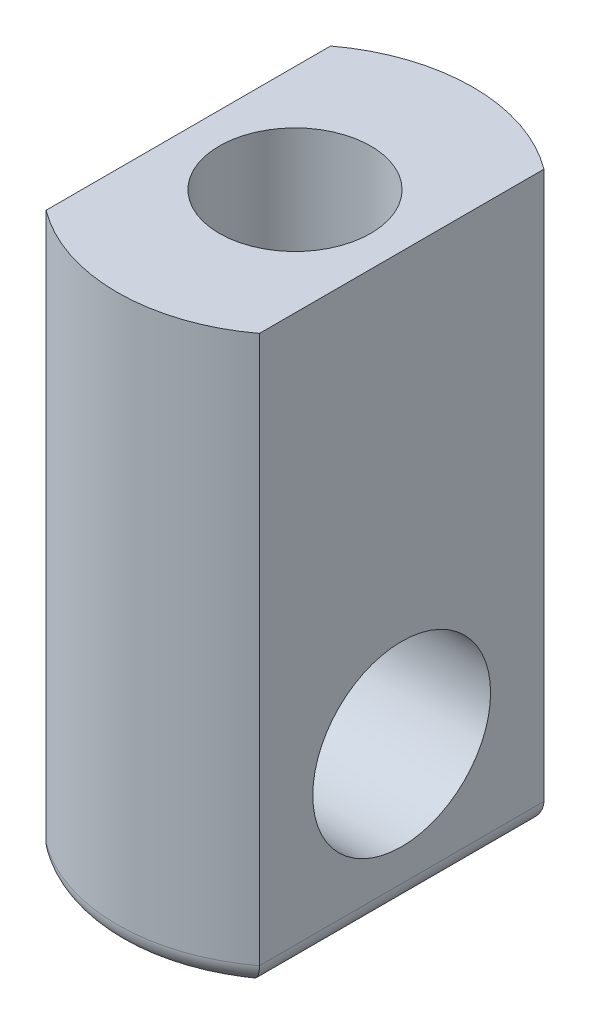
ISO-10303-21;
HEADER;
FILE_DESCRIPTION(('STEP AP214'),'2;1');
FILE_NAME('part.step','',(''),(''),'','','');
FILE_SCHEMA(('AUTOMOTIVE_DESIGN { 1 0 10303 214 1 1 1 1 }'));
ENDSEC;
DATA;
#1=APPLICATION_CONTEXT('core data for automotive mechanical design processes');
#2=APPLICATION_PROTOCOL_DEFINITION('international standard','automotive_design',2000,#1);
#3=PRODUCT_CONTEXT('',#1,'mechanical');
#4=PRODUCT('Part','Part','',(#3));
#5=PRODUCT_RELATED_PRODUCT_CATEGORY('part','',(#4));
#6=PRODUCT_DEFINITION_FORMATION('','',#4);
#7=PRODUCT_DEFINITION_CONTEXT('part definition',#1,'design');
#8=PRODUCT_DEFINITION('design','',#6,#7);
#9=PRODUCT_DEFINITION_SHAPE('','',#8);
#10=(LENGTH_UNIT() NAMED_UNIT(*) SI_UNIT(.MILLI.,.METRE.));
#11=(NAMED_UNIT(*) PLANE_ANGLE_UNIT() SI_UNIT($,.RADIAN.));
#12=(NAMED_UNIT(*) SI_UNIT($,.STERADIAN.) SOLID_ANGLE_UNIT());
#13=UNCERTAINTY_MEASURE_WITH_UNIT(LENGTH_MEASURE(1.E-05),#10,'distance_accuracy_value','');
#14=(GEOMETRIC_REPRESENTATION_CONTEXT(3) GLOBAL_UNCERTAINTY_ASSIGNED_CONTEXT((#13)) GLOBAL_UNIT_ASSIGNED_CONTEXT((#10,
#11,#12)) REPRESENTATION_CONTEXT('',''));
#15=CARTESIAN_POINT('',(0.,0.,0.));
#16=DIRECTION('',(0.,0.,1.));
#17=DIRECTION('',(1.,0.,0.));
#18=AXIS2_PLACEMENT_3D('',#15,#16,#17);
#19=CARTESIAN_POINT('',(0.,10.16,0.));
#20=DIRECTION('',(0.,-1.,0.));
#21=DIRECTION('',(0.,0.,-1.));
#22=AXIS2_PLACEMENT_3D('',#19,#20,#21);
#23=CYLINDRICAL_SURFACE('',#22,3.175);
#24=DIRECTION('',(0.,-1.,0.));
#25=VECTOR('',#24,1.);
#26=CARTESIAN_POINT('',(-1.905,10.16,2.54));
#27=LINE('',#26,#25);
#28=CARTESIAN_POINT('',(-1.905,10.16,2.54));
#29=VERTEX_POINT('',#28);
#30=CARTESIAN_POINT('',(-1.905,0.380999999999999,2.54));
#31=VERTEX_POINT('',#30);
#32=EDGE_CURVE('E112',#29,#31,#27,.T.);
#33=ORIENTED_EDGE('',*,*,#32,.T.);
#34=CARTESIAN_POINT('',(0.,0.380999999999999,0.));
#35=DIRECTION('',(0.,1.,0.));
#36=DIRECTION('',(0.,0.,1.));
#37=AXIS2_PLACEMENT_3D('',#34,#35,#36);
#38=CIRCLE('',#37,3.175);
#39=CARTESIAN_POINT('',(1.905,0.380999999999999,2.54));
#40=VERTEX_POINT('',#39);
#41=EDGE_CURVE('E11',#31,#40,#38,.T.);
#42=ORIENTED_EDGE('',*,*,#41,.T.);
#43=DIRECTION('',(0.,-1.,0.));
#44=VECTOR('',#43,1.);
#45=CARTESIAN_POINT('',(1.905,10.16,2.54));
#46=LINE('',#45,#44);
#47=CARTESIAN_POINT('',(1.905,10.16,2.54));
#48=VERTEX_POINT('',#47);
#49=EDGE_CURVE('E134',#48,#40,#46,.T.);
#50=ORIENTED_EDGE('',*,*,#49,.F.);
#51=CARTESIAN_POINT('',(0.,10.16,0.));
#52=DIRECTION('',(0.,1.,0.));
#53=DIRECTION('',(0.,0.,1.));
#54=AXIS2_PLACEMENT_3D('',#51,#52,#53);
#55=CIRCLE('',#54,3.175);
#56=EDGE_CURVE('E127',#29,#48,#55,.T.);
#57=ORIENTED_EDGE('',*,*,#56,.F.);
#58=EDGE_LOOP('',(#33,#42,#50,#57));
#59=FACE_BOUND('',#58,.T.);
#60=ADVANCED_FACE('F51',(#59),#23,.T.);
#61=DIRECTION('',(0.,-1.,0.));
#62=VECTOR('',#61,1.);
#63=CARTESIAN_POINT('',(1.905,10.16,-2.54));
#64=LINE('',#63,#62);
#65=CARTESIAN_POINT('',(1.905,10.16,-2.54));
#66=VERTEX_POINT('',#65);
#67=CARTESIAN_POINT('',(1.905,0.380999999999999,-2.54));
#68=VERTEX_POINT('',#67);
#69=EDGE_CURVE('E117',#66,#68,#64,.T.);
#70=ORIENTED_EDGE('',*,*,#69,.T.);
#71=CARTESIAN_POINT('',(0.,0.380999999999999,0.));
#72=DIRECTION('',(0.,1.,0.));
#73=DIRECTION('',(0.,0.,1.));
#74=AXIS2_PLACEMENT_3D('',#71,#72,#73);
#75=CIRCLE('',#74,3.175);
#76=CARTESIAN_POINT('',(-1.905,0.380999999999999,-2.54));
#77=VERTEX_POINT('',#76);
#78=EDGE_CURVE('E80',#68,#77,#75,.T.);
#79=ORIENTED_EDGE('',*,*,#78,.T.);
#80=DIRECTION('',(0.,-1.,0.));
#81=VECTOR('',#80,1.);
#82=CARTESIAN_POINT('',(-1.905,10.16,-2.54));
#83=LINE('',#82,#81);
#84=CARTESIAN_POINT('',(-1.905,10.16,-2.54));
#85=VERTEX_POINT('',#84);
#86=EDGE_CURVE('E111',#85,#77,#83,.T.);
#87=ORIENTED_EDGE('',*,*,#86,.F.);
#88=EDGE_CURVE('E121',#66,#85,#55,.T.);
#89=ORIENTED_EDGE('',*,*,#88,.F.);
#90=EDGE_LOOP('',(#70,#79,#87,#89));
#91=FACE_BOUND('',#90,.T.);
#92=ADVANCED_FACE('F120',(#91),#23,.T.);
#93=CARTESIAN_POINT('',(0.,10.16,0.));
#94=DIRECTION('',(0.,1.,0.));
#95=DIRECTION('',(0.,0.,1.));
#96=AXIS2_PLACEMENT_3D('',#93,#94,#95);
#97=PLANE('',#96);
#98=CARTESIAN_POINT('',(0.,10.16,0.));
#99=DIRECTION('',(0.,1.,0.));
#100=DIRECTION('',(0.,0.,1.));
#101=AXIS2_PLACEMENT_3D('',#98,#99,#100);
#102=CIRCLE('',#101,1.35255);
#103=CARTESIAN_POINT('',(0.,10.16,1.35255));
#104=VERTEX_POINT('',#103);
#105=EDGE_CURVE('E144',#104,#104,#102,.T.);
#106=ORIENTED_EDGE('',*,*,#105,.F.);
#107=EDGE_LOOP('',(#106));
#108=FACE_BOUND('',#107,.T.);
#109=DIRECTION('',(0.,0.,1.));
#110=VECTOR('',#109,1.);
#111=CARTESIAN_POINT('',(-1.905,10.16,2.54));
#112=LINE('',#111,#110);
#113=EDGE_CURVE('E109',#85,#29,#112,.T.);
#114=ORIENTED_EDGE('',*,*,#113,.T.);
#115=ORIENTED_EDGE('',*,*,#56,.T.);
#116=DIRECTION('',(0.,0.,-1.));
#117=VECTOR('',#116,1.);
#118=CARTESIAN_POINT('',(1.905,10.16,2.54));
#119=LINE('',#118,#117);
#120=EDGE_CURVE('E125',#48,#66,#119,.T.);
#121=ORIENTED_EDGE('',*,*,#120,.T.);
#122=ORIENTED_EDGE('',*,*,#88,.T.);
#123=EDGE_LOOP('',(#114,#115,#121,#122));
#124=FACE_BOUND('',#123,.T.);
#125=ADVANCED_FACE('F124',(#108,#124),#97,.T.);
#126=CARTESIAN_POINT('',(0.,0.,0.));
#127=DIRECTION('',(0.,1.,0.));
#128=DIRECTION('',(0.,0.,1.));
#129=AXIS2_PLACEMENT_3D('',#126,#127,#128);
#130=PLANE('',#129);
#131=CARTESIAN_POINT('',(0.,0.,0.));
#132=DIRECTION('',(0.,1.,0.));
#133=DIRECTION('',(0.,0.,1.));
#134=AXIS2_PLACEMENT_3D('',#131,#132,#133);
#135=CIRCLE('',#134,2.794);
#136=CARTESIAN_POINT('',(-1.524,0.,-2.34176429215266));
#137=VERTEX_POINT('',#136);
#138=CARTESIAN_POINT('',(1.52399999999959,0.,-2.34176429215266));
#139=VERTEX_POINT('',#138);
#140=EDGE_CURVE('E234',#137,#139,#135,.F.);
#141=ORIENTED_EDGE('',*,*,#140,.T.);
#142=DIRECTION('',(0.,0.,-1.));
#143=VECTOR('',#142,1.);
#144=CARTESIAN_POINT('',(1.524,0.,0.));
#145=LINE('',#144,#143);
#146=CARTESIAN_POINT('',(1.52399999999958,0.,2.34176429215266));
#147=VERTEX_POINT('',#146);
#148=EDGE_CURVE('E229',#139,#147,#145,.F.);
#149=ORIENTED_EDGE('',*,*,#148,.T.);
#150=CARTESIAN_POINT('',(0.,0.,0.));
#151=DIRECTION('',(0.,1.,0.));
#152=DIRECTION('',(0.,0.,1.));
#153=AXIS2_PLACEMENT_3D('',#150,#151,#152);
#154=CIRCLE('',#153,2.794);
#155=CARTESIAN_POINT('',(-1.52399999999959,0.,2.34176429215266));
#156=VERTEX_POINT('',#155);
#157=EDGE_CURVE('E130',#147,#156,#154,.F.);
#158=ORIENTED_EDGE('',*,*,#157,.T.);
#159=DIRECTION('',(0.,0.,1.));
#160=VECTOR('',#159,1.);
#161=CARTESIAN_POINT('',(-1.524,0.,0.));
#162=LINE('',#161,#160);
#163=EDGE_CURVE('E238',#156,#137,#162,.F.);
#164=ORIENTED_EDGE('',*,*,#163,.T.);
#165=EDGE_LOOP('',(#141,#149,#158,#164));
#166=FACE_BOUND('',#165,.T.);
#167=ADVANCED_FACE('F171',(#166),#130,.F.);
#168=CARTESIAN_POINT('',(1.905,10.16,2.54));
#169=DIRECTION('',(-1.,0.,0.));
#170=DIRECTION('',(0.,0.,1.));
#171=AXIS2_PLACEMENT_3D('',#168,#169,#170);
#172=PLANE('',#171);
#173=CARTESIAN_POINT('',(1.905,2.54,0.));
#174=DIRECTION('',(1.,0.,0.));
#175=DIRECTION('',(0.,0.,-1.));
#176=AXIS2_PLACEMENT_3D('',#173,#174,#175);
#177=CIRCLE('',#176,1.5875);
#178=CARTESIAN_POINT('',(1.905,2.54,-1.5875));
#179=VERTEX_POINT('',#178);
#180=EDGE_CURVE('E143',#179,#179,#177,.T.);
#181=ORIENTED_EDGE('',*,*,#180,.F.);
#182=EDGE_LOOP('',(#181));
#183=FACE_BOUND('',#182,.T.);
#184=ORIENTED_EDGE('',*,*,#49,.T.);
#185=DIRECTION('',(0.,0.,-1.));
#186=VECTOR('',#185,1.);
#187=CARTESIAN_POINT('',(1.905,0.380999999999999,2.54));
#188=LINE('',#187,#186);
#189=EDGE_CURVE('E126',#40,#68,#188,.T.);
#190=ORIENTED_EDGE('',*,*,#189,.T.);
#191=ORIENTED_EDGE('',*,*,#69,.F.);
#192=ORIENTED_EDGE('',*,*,#120,.F.);
#193=EDGE_LOOP('',(#184,#190,#191,#192));
#194=FACE_BOUND('',#193,.T.);
#195=ADVANCED_FACE('F224',(#183,#194),#172,.F.);
#196=CARTESIAN_POINT('',(-1.905,10.16,2.54));
#197=DIRECTION('',(1.,0.,0.));
#198=DIRECTION('',(0.,0.,-1.));
#199=AXIS2_PLACEMENT_3D('',#196,#197,#198);
#200=PLANE('',#199);
#201=CARTESIAN_POINT('',(-1.905,2.54,0.));
#202=DIRECTION('',(1.,0.,0.));
#203=DIRECTION('',(0.,0.,-1.));
#204=AXIS2_PLACEMENT_3D('',#201,#202,#203);
#205=CIRCLE('',#204,1.5875);
#206=CARTESIAN_POINT('',(-1.905,2.54,-1.5875));
#207=VERTEX_POINT('',#206);
#208=EDGE_CURVE('E215',#207,#207,#205,.T.);
#209=ORIENTED_EDGE('',*,*,#208,.T.);
#210=EDGE_LOOP('',(#209));
#211=FACE_BOUND('',#210,.T.);
#212=ORIENTED_EDGE('',*,*,#86,.T.);
#213=DIRECTION('',(0.,0.,1.));
#214=VECTOR('',#213,1.);
#215=CARTESIAN_POINT('',(-1.905,0.380999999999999,2.54));
#216=LINE('',#215,#214);
#217=EDGE_CURVE('E65',#77,#31,#216,.T.);
#218=ORIENTED_EDGE('',*,*,#217,.T.);
#219=ORIENTED_EDGE('',*,*,#32,.F.);
#220=ORIENTED_EDGE('',*,*,#113,.F.);
#221=EDGE_LOOP('',(#212,#218,#219,#220));
#222=FACE_BOUND('',#221,.T.);
#223=ADVANCED_FACE('F110',(#211,#222),#200,.F.);
#224=CARTESIAN_POINT('',(-1.905,2.54,0.));
#225=DIRECTION('',(1.,0.,0.));
#226=DIRECTION('',(0.,0.,-1.));
#227=AXIS2_PLACEMENT_3D('',#224,#225,#226);
#228=CYLINDRICAL_SURFACE('',#227,1.5875);
#229=CARTESIAN_POINT('',(0.,3.37112258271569,1.35255));
#230=CARTESIAN_POINT('',(0.045934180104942,3.37113229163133,1.35254649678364));
#231=CARTESIAN_POINT('',(0.0919452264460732,3.37501786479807,1.35017916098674));
#232=CARTESIAN_POINT('',(0.182421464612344,3.38971828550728,1.34097097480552));
#233=CARTESIAN_POINT('',(0.226880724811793,3.40055718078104,1.33411459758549));
#234=CARTESIAN_POINT('',(0.331196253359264,3.43278611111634,1.31285522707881));
#235=CARTESIAN_POINT('',(0.389855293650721,3.4566829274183,1.29650738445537));
#236=CARTESIAN_POINT('',(0.502340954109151,3.50986765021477,1.25722556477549));
#237=CARTESIAN_POINT('',(0.556149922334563,3.53917415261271,1.23426871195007));
#238=CARTESIAN_POINT('',(0.685380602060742,3.61543385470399,1.16927502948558));
#239=CARTESIAN_POINT('',(0.758047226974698,3.66384411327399,1.12345076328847));
#240=CARTESIAN_POINT('',(0.893861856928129,3.759628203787,1.01868892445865));
#241=CARTESIAN_POINT('',(0.95701921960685,3.80700301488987,0.959764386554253));
#242=CARTESIAN_POINT('',(1.05979683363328,3.88652605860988,0.843120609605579));
#243=CARTESIAN_POINT('',(1.10153674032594,3.91972896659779,0.787997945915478));
#244=CARTESIAN_POINT('',(1.17707851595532,3.98075795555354,0.669904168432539));
#245=CARTESIAN_POINT('',(1.21089350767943,4.00859291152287,0.60694629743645));
#246=CARTESIAN_POINT('',(1.26363828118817,4.05240646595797,0.48595231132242));
#247=CARTESIAN_POINT('',(1.28414966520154,4.06961591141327,0.429056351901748));
#248=CARTESIAN_POINT('',(1.31758411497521,4.09779038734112,0.311583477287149));
#249=CARTESIAN_POINT('',(1.33051163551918,4.10875908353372,0.251008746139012));
#250=CARTESIAN_POINT('',(1.34797697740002,4.12359880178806,0.127494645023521));
#251=CARTESIAN_POINT('',(1.3524758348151,4.12743685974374,0.0645456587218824));
#252=CARTESIAN_POINT('',(1.35262230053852,4.12756155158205,-0.0613694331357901));
#253=CARTESIAN_POINT('',(1.34827070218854,4.12384886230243,-0.124335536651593));
#254=CARTESIAN_POINT('',(1.33170117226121,4.10976937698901,-0.243547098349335));
#255=CARTESIAN_POINT('',(1.32009648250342,4.09992149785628,-0.299942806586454));
#256=CARTESIAN_POINT('',(1.29027386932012,4.07476626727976,-0.409657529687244));
#257=CARTESIAN_POINT('',(1.27205489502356,4.0594580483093,-0.462976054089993));
#258=CARTESIAN_POINT('',(1.228187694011,4.02291951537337,-0.569676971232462));
#259=CARTESIAN_POINT('',(1.20206902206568,4.00131902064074,-0.622736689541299));
#260=CARTESIAN_POINT('',(1.14414792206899,3.95405798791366,-0.723677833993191));
#261=CARTESIAN_POINT('',(1.11234113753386,3.92839433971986,-0.771555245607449));
#262=CARTESIAN_POINT('',(1.02684974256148,3.8606794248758,-0.884412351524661));
#263=CARTESIAN_POINT('',(0.970155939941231,3.81682971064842,-0.946042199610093));
#264=CARTESIAN_POINT('',(0.847655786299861,3.72639953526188,-1.05723677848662));
#265=CARTESIAN_POINT('',(0.781829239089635,3.67981315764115,-1.10677407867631));
#266=CARTESIAN_POINT('',(0.657121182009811,3.59870757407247,-1.18393064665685));
#267=CARTESIAN_POINT('',(0.599967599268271,3.56381531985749,-1.21397416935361));
#268=CARTESIAN_POINT('',(0.479894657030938,3.49839595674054,-1.26624025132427));
#269=CARTESIAN_POINT('',(0.41699338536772,3.46785587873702,-1.28848634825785));
#270=CARTESIAN_POINT('',(0.310196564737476,3.42633786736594,-1.31717214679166));
#271=CARTESIAN_POINT('',(0.268250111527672,3.41234770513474,-1.3264023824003));
#272=CARTESIAN_POINT('',(0.18228199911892,3.38987125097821,-1.34091590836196));
#273=CARTESIAN_POINT('',(0.13826591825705,3.38137098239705,-1.34620922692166));
#274=CARTESIAN_POINT('',(0.0486524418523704,3.37135061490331,-1.35242516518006));
#275=CARTESIAN_POINT('',(0.00304387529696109,3.36989876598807,-1.35330505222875));
#276=CARTESIAN_POINT('',(-0.0876609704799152,3.37449873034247,-1.35047119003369));
#277=CARTESIAN_POINT('',(-0.132756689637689,3.3805580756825,-1.34675282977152));
#278=CARTESIAN_POINT('',(-0.229686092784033,3.40072001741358,-1.33397091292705));
#279=CARTESIAN_POINT('',(-0.281106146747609,3.41616728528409,-1.32400187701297));
#280=CARTESIAN_POINT('',(-0.380527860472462,3.45291584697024,-1.29893665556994));
#281=CARTESIAN_POINT('',(-0.428516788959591,3.47423764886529,-1.28382246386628));
#282=CARTESIAN_POINT('',(-0.551387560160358,3.53515273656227,-1.23776653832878));
#283=CARTESIAN_POINT('',(-0.623379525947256,3.57758869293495,-1.20293294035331));
#284=CARTESIAN_POINT('',(-0.7593381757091,3.66457859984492,-1.1220741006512));
#285=CARTESIAN_POINT('',(-0.823290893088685,3.7091360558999,-1.07602977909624));
#286=CARTESIAN_POINT('',(-0.945711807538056,3.79829614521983,-0.970481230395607));
#287=CARTESIAN_POINT('',(-1.00381180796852,3.84281343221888,-0.910471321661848));
#288=CARTESIAN_POINT('',(-1.10939982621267,3.92581490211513,-0.778286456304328));
#289=CARTESIAN_POINT('',(-1.15691925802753,3.9643168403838,-0.706148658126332));
#290=CARTESIAN_POINT('',(-1.22581560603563,4.02092450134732,-0.574823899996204));
#291=CARTESIAN_POINT('',(-1.25072362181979,4.04164628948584,-0.518615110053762));
#292=CARTESIAN_POINT('',(-1.29303627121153,4.07706616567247,-0.401630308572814));
#293=CARTESIAN_POINT('',(-1.31044643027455,4.09176868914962,-0.34085769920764));
#294=CARTESIAN_POINT('',(-1.33676375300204,4.1140561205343,-0.215778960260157));
#295=CARTESIAN_POINT('',(-1.34561596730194,4.12159502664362,-0.151452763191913));
#296=CARTESIAN_POINT('',(-1.35393276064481,4.12867662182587,-0.0217600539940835));
#297=CARTESIAN_POINT('',(-1.35340088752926,4.12822233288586,0.0436060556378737));
#298=CARTESIAN_POINT('',(-1.34352607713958,4.11981708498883,0.166608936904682));
#299=CARTESIAN_POINT('',(-1.33505812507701,4.11261060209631,0.224371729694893));
#300=CARTESIAN_POINT('',(-1.3110825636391,4.09230852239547,0.337327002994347));
#301=CARTESIAN_POINT('',(-1.29557351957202,4.0792117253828,0.392518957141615));
#302=CARTESIAN_POINT('',(-1.25756240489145,4.04735385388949,0.501387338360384));
#303=CARTESIAN_POINT('',(-1.23480163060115,4.02838411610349,0.554910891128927));
#304=CARTESIAN_POINT('',(-1.18351783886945,3.98612232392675,0.657234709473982));
#305=CARTESIAN_POINT('',(-1.15499323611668,3.96282908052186,0.706033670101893));
#306=CARTESIAN_POINT('',(-1.07812755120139,3.90101747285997,0.820877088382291));
#307=CARTESIAN_POINT('',(-1.02685364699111,3.86056443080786,0.883928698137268));
#308=CARTESIAN_POINT('',(-0.915408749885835,3.77588665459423,0.998936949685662));
#309=CARTESIAN_POINT('',(-0.855203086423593,3.73164752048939,1.05084833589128));
#310=CARTESIAN_POINT('',(-0.725425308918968,3.6421358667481,1.14441538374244));
#311=CARTESIAN_POINT('',(-0.655690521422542,3.59686031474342,1.1858461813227));
#312=CARTESIAN_POINT('',(-0.544527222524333,3.53316582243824,1.23876934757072));
#313=CARTESIAN_POINT('',(-0.506439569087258,3.5126643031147,1.25485645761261));
#314=CARTESIAN_POINT('',(-0.427864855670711,3.47416126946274,1.28377334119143));
#315=CARTESIAN_POINT('',(-0.387381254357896,3.45615627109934,1.29660767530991));
#316=CARTESIAN_POINT('',(-0.303732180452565,3.42403726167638,1.31871797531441));
#317=CARTESIAN_POINT('',(-0.260557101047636,3.40993829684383,1.32798023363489));
#318=CARTESIAN_POINT('',(-0.172101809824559,3.38769161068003,1.34229548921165));
#319=CARTESIAN_POINT('',(-0.126831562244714,3.37951829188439,1.34736660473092));
#320=CARTESIAN_POINT('',(-0.0676508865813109,3.37376184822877,1.35092508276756));
#321=CARTESIAN_POINT('',(-0.0541504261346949,3.37277550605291,1.35153320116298));
#322=CARTESIAN_POINT('',(-0.027102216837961,3.37145434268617,1.35234623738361));
#323=CARTESIAN_POINT('',(-0.0135544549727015,3.3711197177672,1.35255103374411));
#324=CARTESIAN_POINT('',(0.,3.37112258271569,1.35255));
#325=B_SPLINE_CURVE_WITH_KNOTS('',3,(#229,#230,#231,#232,#233,#234,#235,#236,#237,#238,#239,
#240,#241,#242,#243,#244,#245,#246,#247,#248,#249,#250,#251,#252,#253,#254,#255,#256,#257,#258,
#259,#260,#261,#262,#263,#264,#265,#266,#267,#268,#269,#270,#271,#272,#273,#274,#275,#276,#277,
#278,#279,#280,#281,#282,#283,#284,#285,#286,#287,#288,#289,#290,#291,#292,#293,#294,#295,#296,
#297,#298,#299,#300,#301,#302,#303,#304,#305,#306,#307,#308,#309,#310,#311,#312,#313,#314,#315,
#316,#317,#318,#319,#320,#321,#322,#323,#324),.UNSPECIFIED.,.T.,.F.,(4,2,2,2,2,2,2,2,2,2,2,2,2,
2,2,2,2,2,2,2,2,2,2,2,2,2,2,2,2,2,2,2,2,2,2,2,2,2,2,2,2,2,2,2,2,2,2,4),(0.,0.137740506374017,
0.275959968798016,0.471087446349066,0.666898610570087,0.96127586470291,1.25536151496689,
1.48463192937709,1.71351997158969,1.90138620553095,2.08914197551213,2.27776357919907,
2.4663682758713,2.64085443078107,2.81536832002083,3.00356317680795,3.19190279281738,
3.47399237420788,3.75671601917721,3.97635216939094,4.19531948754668,4.33041209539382,
4.46515940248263,4.6012089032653,4.73739494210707,4.90029675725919,5.06377463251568,
5.33394888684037,5.60458621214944,5.88720611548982,6.16897537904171,6.36286208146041,
6.55660565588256,6.75158512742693,6.94649088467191,7.12215612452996,7.29785717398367,
7.48070245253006,7.66359809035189,7.934452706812,8.206387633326,8.48373886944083,
8.62201178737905,8.76008975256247,8.89869243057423,9.03669274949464,9.07732557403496,
9.11797063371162),.UNSPECIFIED.);
#326=CARTESIAN_POINT('',(0.,3.37112258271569,1.35255));
#327=VERTEX_POINT('',#326);
#328=EDGE_CURVE('E136',#327,#327,#325,.T.);
#329=ORIENTED_EDGE('',*,*,#328,.T.);
#330=EDGE_LOOP('',(#329));
#331=FACE_BOUND('',#330,.T.);
#332=ORIENTED_EDGE('',*,*,#208,.F.);
#333=EDGE_LOOP('',(#332));
#334=FACE_BOUND('',#333,.T.);
#335=ORIENTED_EDGE('',*,*,#180,.T.);
#336=EDGE_LOOP('',(#335));
#337=FACE_BOUND('',#336,.T.);
#338=ADVANCED_FACE('F146',(#331,#334,#337),#228,.F.);
#339=CARTESIAN_POINT('',(0.,10.16,0.));
#340=DIRECTION('',(0.,1.,0.));
#341=DIRECTION('',(0.,0.,1.));
#342=AXIS2_PLACEMENT_3D('',#339,#340,#341);
#343=CYLINDRICAL_SURFACE('',#342,1.35255);
#344=ORIENTED_EDGE('',*,*,#105,.T.);
#345=EDGE_LOOP('',(#344));
#346=FACE_BOUND('',#345,.T.);
#347=ORIENTED_EDGE('',*,*,#328,.F.);
#348=EDGE_LOOP('',(#347));
#349=FACE_BOUND('',#348,.T.);
#350=ADVANCED_FACE('F149',(#346,#349),#343,.F.);
#351=CARTESIAN_POINT('',(-1.524,0.380999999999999,2.54));
#352=DIRECTION('',(0.,0.,1.));
#353=DIRECTION('',(1.,0.,0.));
#354=AXIS2_PLACEMENT_3D('',#351,#352,#353);
#355=CYLINDRICAL_SURFACE('',#354,0.381);
#356=CARTESIAN_POINT('',(-1.905,0.380999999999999,-2.54));
#357=CARTESIAN_POINT('',(-1.90502421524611,0.361214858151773,-2.54001076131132));
#358=CARTESIAN_POINT('',(-1.90346055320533,0.341447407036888,-2.53923027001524));
#359=CARTESIAN_POINT('',(-1.89734965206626,0.302566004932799,-2.53617275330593));
#360=CARTESIAN_POINT('',(-1.89281278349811,0.283450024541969,-2.53390092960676));
#361=CARTESIAN_POINT('',(-1.88094827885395,0.246354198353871,-2.52794717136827));
#362=CARTESIAN_POINT('',(-1.87362206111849,0.228373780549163,-2.5242659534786));
#363=CARTESIAN_POINT('',(-1.85648796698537,0.193964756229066,-2.51563076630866));
#364=CARTESIAN_POINT('',(-1.84667869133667,0.177537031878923,-2.51067607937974));
#365=CARTESIAN_POINT('',(-1.82450198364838,0.145953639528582,-2.49943348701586));
#366=CARTESIAN_POINT('',(-1.8120477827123,0.13087533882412,-2.49310010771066));
#367=CARTESIAN_POINT('',(-1.785269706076,0.103020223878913,-2.47942167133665));
#368=CARTESIAN_POINT('',(-1.77094530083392,0.0902440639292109,-2.47207632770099));
#369=CARTESIAN_POINT('',(-1.73933666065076,0.0659977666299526,-2.45578659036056));
#370=CARTESIAN_POINT('',(-1.72189970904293,0.0547851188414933,-2.44675577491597));
#371=CARTESIAN_POINT('',(-1.68576736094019,0.0354384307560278,-2.4279286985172));
#372=CARTESIAN_POINT('',(-1.66707101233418,0.0273067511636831,-2.41813185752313));
#373=CARTESIAN_POINT('',(-1.62845025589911,0.0140147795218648,-2.39776350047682));
#374=CARTESIAN_POINT('',(-1.60850735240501,0.00892843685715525,-2.38717922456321));
#375=CARTESIAN_POINT('',(-1.56827650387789,0.00203313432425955,-2.3656790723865));
#376=CARTESIAN_POINT('',(-1.54798931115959,0.00021777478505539,-2.3547638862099));
#377=CARTESIAN_POINT('',(-1.52649899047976,6.13506016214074E-06,-2.34311926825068));
#378=CARTESIAN_POINT('',(-1.52524937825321,-1.1652303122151E-08,-2.34244186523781));
#379=CARTESIAN_POINT('',(-1.524,0.,-2.34176429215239));
#380=B_SPLINE_CURVE_WITH_KNOTS('',3,(#356,#357,#358,#359,#360,#361,#362,#363,#364,#365,#366,
#367,#368,#369,#370,#371,#372,#373,#374,#375,#376,#377,#378,#379),.UNSPECIFIED.,.F.,.F.,(4,2,2,
2,2,2,2,2,2,2,2,4),(0.,0.0592507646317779,0.118295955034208,0.177311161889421,0.236359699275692,
0.297774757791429,0.359207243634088,0.42676905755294,0.494382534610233,0.5635774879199,
0.632636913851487,0.636901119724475),.UNSPECIFIED.);
#381=EDGE_CURVE('E188',#137,#77,#380,.F.);
#382=ORIENTED_EDGE('',*,*,#381,.F.);
#383=ORIENTED_EDGE('',*,*,#163,.F.);
#384=CARTESIAN_POINT('',(-1.905,0.380999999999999,2.54));
#385=CARTESIAN_POINT('',(-1.90502421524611,0.361214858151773,2.54001076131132));
#386=CARTESIAN_POINT('',(-1.90346055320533,0.341447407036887,2.53923027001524));
#387=CARTESIAN_POINT('',(-1.89734965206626,0.302566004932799,2.53617275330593));
#388=CARTESIAN_POINT('',(-1.89281278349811,0.283450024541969,2.53390092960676));
#389=CARTESIAN_POINT('',(-1.88094827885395,0.246354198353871,2.52794717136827));
#390=CARTESIAN_POINT('',(-1.87362206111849,0.228373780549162,2.5242659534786));
#391=CARTESIAN_POINT('',(-1.85648796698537,0.193964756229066,2.51563076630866));
#392=CARTESIAN_POINT('',(-1.84667869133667,0.177537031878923,2.51067607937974));
#393=CARTESIAN_POINT('',(-1.82450198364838,0.145953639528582,2.49943348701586));
#394=CARTESIAN_POINT('',(-1.8120477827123,0.13087533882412,2.49310010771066));
#395=CARTESIAN_POINT('',(-1.785269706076,0.103020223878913,2.47942167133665));
#396=CARTESIAN_POINT('',(-1.77094530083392,0.090244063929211,2.47207632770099));
#397=CARTESIAN_POINT('',(-1.73933666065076,0.0659977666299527,2.45578659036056));
#398=CARTESIAN_POINT('',(-1.72189970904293,0.0547851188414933,2.44675577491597));
#399=CARTESIAN_POINT('',(-1.68576736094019,0.0354384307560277,2.4279286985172));
#400=CARTESIAN_POINT('',(-1.66707101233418,0.027306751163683,2.41813185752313));
#401=CARTESIAN_POINT('',(-1.62845025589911,0.0140147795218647,2.39776350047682));
#402=CARTESIAN_POINT('',(-1.60850735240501,0.00892843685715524,2.3871792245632));
#403=CARTESIAN_POINT('',(-1.56827650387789,0.00203313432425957,2.36567907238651));
#404=CARTESIAN_POINT('',(-1.54798931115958,0.000217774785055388,2.35476388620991));
#405=CARTESIAN_POINT('',(-1.52649899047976,6.13506016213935E-06,2.34311926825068));
#406=CARTESIAN_POINT('',(-1.52524937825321,-1.16523031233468E-08,2.34244186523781));
#407=CARTESIAN_POINT('',(-1.524,0.,2.34176429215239));
#408=B_SPLINE_CURVE_WITH_KNOTS('',3,(#384,#385,#386,#387,#388,#389,#390,#391,#392,#393,#394,
#395,#396,#397,#398,#399,#400,#401,#402,#403,#404,#405,#406,#407),.UNSPECIFIED.,.F.,.F.,(4,2,2,
2,2,2,2,2,2,2,2,4),(0.,0.059250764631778,0.118295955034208,0.177311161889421,0.236359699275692,
0.297774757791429,0.359207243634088,0.42676905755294,0.494382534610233,0.5635774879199,
0.632636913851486,0.636901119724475),.UNSPECIFIED.);
#409=EDGE_CURVE('E56',#31,#156,#408,.T.);
#410=ORIENTED_EDGE('',*,*,#409,.F.);
#411=ORIENTED_EDGE('',*,*,#217,.F.);
#412=EDGE_LOOP('',(#382,#383,#410,#411));
#413=FACE_BOUND('',#412,.T.);
#414=ADVANCED_FACE('F53',(#413),#355,.T.);
#415=CARTESIAN_POINT('',(0.,0.380999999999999,0.));
#416=DIRECTION('',(0.,1.,0.));
#417=DIRECTION('',(0.,0.,1.));
#418=AXIS2_PLACEMENT_3D('',#415,#416,#417);
#419=TOROIDAL_SURFACE('',#418,2.794,0.381);
#420=ORIENTED_EDGE('',*,*,#409,.T.);
#421=ORIENTED_EDGE('',*,*,#157,.F.);
#422=CARTESIAN_POINT('',(1.905,0.380999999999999,2.54));
#423=CARTESIAN_POINT('',(1.90502421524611,0.361214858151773,2.54001076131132));
#424=CARTESIAN_POINT('',(1.90346055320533,0.341447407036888,2.53923027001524));
#425=CARTESIAN_POINT('',(1.89734965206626,0.302566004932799,2.53617275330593));
#426=CARTESIAN_POINT('',(1.89281278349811,0.283450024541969,2.53390092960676));
#427=CARTESIAN_POINT('',(1.88094827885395,0.246354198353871,2.52794717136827));
#428=CARTESIAN_POINT('',(1.87362206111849,0.228373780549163,2.5242659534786));
#429=CARTESIAN_POINT('',(1.85648796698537,0.193964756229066,2.51563076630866));
#430=CARTESIAN_POINT('',(1.84667869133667,0.177537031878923,2.51067607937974));
#431=CARTESIAN_POINT('',(1.82450198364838,0.145953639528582,2.49943348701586));
#432=CARTESIAN_POINT('',(1.8120477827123,0.13087533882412,2.49310010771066));
#433=CARTESIAN_POINT('',(1.785269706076,0.103020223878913,2.47942167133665));
#434=CARTESIAN_POINT('',(1.77094530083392,0.0902440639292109,2.47207632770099));
#435=CARTESIAN_POINT('',(1.73933666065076,0.0659977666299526,2.45578659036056));
#436=CARTESIAN_POINT('',(1.72189970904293,0.0547851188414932,2.44675577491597));
#437=CARTESIAN_POINT('',(1.68576736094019,0.0354384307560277,2.4279286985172));
#438=CARTESIAN_POINT('',(1.66707101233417,0.0273067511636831,2.41813185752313));
#439=CARTESIAN_POINT('',(1.62845025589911,0.0140147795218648,2.39776350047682));
#440=CARTESIAN_POINT('',(1.60850735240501,0.00892843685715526,2.3871792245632));
#441=CARTESIAN_POINT('',(1.56827650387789,0.00203313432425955,2.36567907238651));
#442=CARTESIAN_POINT('',(1.54798931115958,0.000217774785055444,2.35476388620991));
#443=CARTESIAN_POINT('',(1.52649899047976,6.13506016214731E-06,2.34311926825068));
#444=CARTESIAN_POINT('',(1.52524937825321,-1.16523031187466E-08,2.34244186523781));
#445=CARTESIAN_POINT('',(1.524,0.,2.34176429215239));
#446=B_SPLINE_CURVE_WITH_KNOTS('',3,(#422,#423,#424,#425,#426,#427,#428,#429,#430,#431,#432,
#433,#434,#435,#436,#437,#438,#439,#440,#441,#442,#443,#444,#445),.UNSPECIFIED.,.F.,.F.,(4,2,2,
2,2,2,2,2,2,2,2,4),(0.,0.0592507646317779,0.118295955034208,0.177311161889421,0.236359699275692,
0.297774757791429,0.359207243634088,0.42676905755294,0.494382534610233,0.563577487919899,
0.632636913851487,0.636901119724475),.UNSPECIFIED.);
#447=EDGE_CURVE('E194',#40,#147,#446,.T.);
#448=ORIENTED_EDGE('',*,*,#447,.F.);
#449=ORIENTED_EDGE('',*,*,#41,.F.);
#450=EDGE_LOOP('',(#420,#421,#448,#449));
#451=FACE_BOUND('',#450,.T.);
#452=ADVANCED_FACE('F156',(#451),#419,.T.);
#453=CARTESIAN_POINT('',(0.,0.380999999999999,0.));
#454=DIRECTION('',(0.,1.,0.));
#455=DIRECTION('',(0.,0.,1.));
#456=AXIS2_PLACEMENT_3D('',#453,#454,#455);
#457=TOROIDAL_SURFACE('',#456,2.794,0.381);
#458=ORIENTED_EDGE('',*,*,#381,.T.);
#459=ORIENTED_EDGE('',*,*,#78,.F.);
#460=CARTESIAN_POINT('',(1.905,0.380999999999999,-2.54));
#461=CARTESIAN_POINT('',(1.90502421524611,0.361214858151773,-2.54001076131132));
#462=CARTESIAN_POINT('',(1.90346055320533,0.341447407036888,-2.53923027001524));
#463=CARTESIAN_POINT('',(1.89734965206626,0.302566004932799,-2.53617275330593));
#464=CARTESIAN_POINT('',(1.89281278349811,0.283450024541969,-2.53390092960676));
#465=CARTESIAN_POINT('',(1.88094827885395,0.246354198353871,-2.52794717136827));
#466=CARTESIAN_POINT('',(1.87362206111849,0.228373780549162,-2.5242659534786));
#467=CARTESIAN_POINT('',(1.85648796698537,0.193964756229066,-2.51563076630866));
#468=CARTESIAN_POINT('',(1.84667869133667,0.177537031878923,-2.51067607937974));
#469=CARTESIAN_POINT('',(1.82450198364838,0.145953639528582,-2.49943348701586));
#470=CARTESIAN_POINT('',(1.8120477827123,0.13087533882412,-2.49310010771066));
#471=CARTESIAN_POINT('',(1.785269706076,0.103020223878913,-2.47942167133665));
#472=CARTESIAN_POINT('',(1.77094530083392,0.0902440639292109,-2.47207632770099));
#473=CARTESIAN_POINT('',(1.73933666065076,0.0659977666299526,-2.45578659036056));
#474=CARTESIAN_POINT('',(1.72189970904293,0.0547851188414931,-2.44675577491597));
#475=CARTESIAN_POINT('',(1.68576736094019,0.0354384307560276,-2.4279286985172));
#476=CARTESIAN_POINT('',(1.66707101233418,0.0273067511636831,-2.41813185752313));
#477=CARTESIAN_POINT('',(1.62845025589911,0.0140147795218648,-2.39776350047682));
#478=CARTESIAN_POINT('',(1.60850735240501,0.00892843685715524,-2.38717922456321));
#479=CARTESIAN_POINT('',(1.56827650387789,0.00203313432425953,-2.3656790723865));
#480=CARTESIAN_POINT('',(1.54798931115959,0.000217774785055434,-2.35476388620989));
#481=CARTESIAN_POINT('',(1.52649899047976,6.13506016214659E-06,-2.34311926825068));
#482=CARTESIAN_POINT('',(1.52524937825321,-1.16523031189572E-08,-2.34244186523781));
#483=CARTESIAN_POINT('',(1.524,0.,-2.34176429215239));
#484=B_SPLINE_CURVE_WITH_KNOTS('',3,(#460,#461,#462,#463,#464,#465,#466,#467,#468,#469,#470,
#471,#472,#473,#474,#475,#476,#477,#478,#479,#480,#481,#482,#483),.UNSPECIFIED.,.F.,.F.,(4,2,2,
2,2,2,2,2,2,2,2,4),(0.,0.0592507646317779,0.118295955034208,0.177311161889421,0.236359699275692,
0.297774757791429,0.359207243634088,0.42676905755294,0.494382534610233,0.5635774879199,
0.632636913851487,0.636901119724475),.UNSPECIFIED.);
#485=EDGE_CURVE('E182',#139,#68,#484,.F.);
#486=ORIENTED_EDGE('',*,*,#485,.F.);
#487=ORIENTED_EDGE('',*,*,#140,.F.);
#488=EDGE_LOOP('',(#458,#459,#486,#487));
#489=FACE_BOUND('',#488,.T.);
#490=ADVANCED_FACE('F173',(#489),#457,.T.);
#491=CARTESIAN_POINT('',(1.524,0.380999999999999,2.54));
#492=DIRECTION('',(0.,0.,-1.));
#493=DIRECTION('',(-1.,0.,0.));
#494=AXIS2_PLACEMENT_3D('',#491,#492,#493);
#495=CYLINDRICAL_SURFACE('',#494,0.381);
#496=ORIENTED_EDGE('',*,*,#447,.T.);
#497=ORIENTED_EDGE('',*,*,#148,.F.);
#498=ORIENTED_EDGE('',*,*,#485,.T.);
#499=ORIENTED_EDGE('',*,*,#189,.F.);
#500=EDGE_LOOP('',(#496,#497,#498,#499));
#501=FACE_BOUND('',#500,.T.);
#502=ADVANCED_FACE('F177',(#501),#495,.T.);
#503=CLOSED_SHELL('',(#60,#92,#125,#167,#195,#223,#338,#350,#414,#452,#490,#502));
#504=MANIFOLD_SOLID_BREP('B2',#503);
#505=ADVANCED_BREP_SHAPE_REPRESENTATION('',(#18,#504),#14);
#506=SHAPE_DEFINITION_REPRESENTATION(#9,#505);
ENDSEC;
END-ISO-10303-21;
